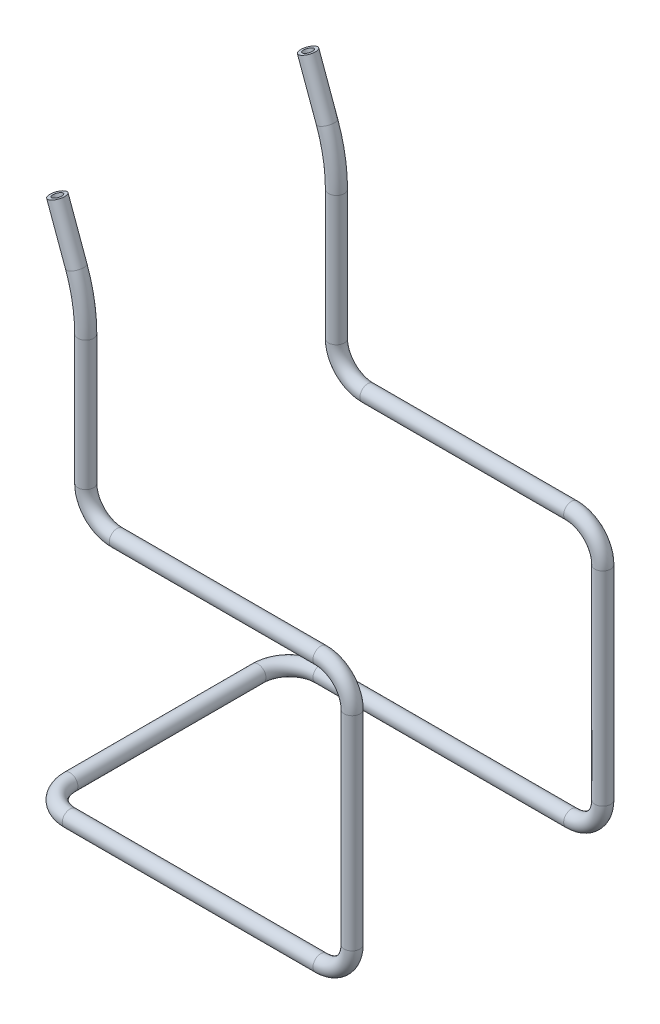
ISO-10303-21;
HEADER;
FILE_DESCRIPTION(('STEP AP214'),'2;1');
FILE_NAME('part.step','',(''),(''),'','','');
FILE_SCHEMA(('AUTOMOTIVE_DESIGN { 1 0 10303 214 1 1 1 1 }'));
ENDSEC;
DATA;
#1=APPLICATION_CONTEXT('core data for automotive mechanical design processes');
#2=APPLICATION_PROTOCOL_DEFINITION('international standard','automotive_design',2000,#1);
#3=PRODUCT_CONTEXT('',#1,'mechanical');
#4=PRODUCT('Part','Part','',(#3));
#5=PRODUCT_RELATED_PRODUCT_CATEGORY('part','',(#4));
#6=PRODUCT_DEFINITION_FORMATION('','',#4);
#7=PRODUCT_DEFINITION_CONTEXT('part definition',#1,'design');
#8=PRODUCT_DEFINITION('design','',#6,#7);
#9=PRODUCT_DEFINITION_SHAPE('','',#8);
#10=(LENGTH_UNIT() NAMED_UNIT(*) SI_UNIT(.MILLI.,.METRE.));
#11=(NAMED_UNIT(*) PLANE_ANGLE_UNIT() SI_UNIT($,.RADIAN.));
#12=(NAMED_UNIT(*) SI_UNIT($,.STERADIAN.) SOLID_ANGLE_UNIT());
#13=UNCERTAINTY_MEASURE_WITH_UNIT(LENGTH_MEASURE(1.E-05),#10,'distance_accuracy_value','');
#14=(GEOMETRIC_REPRESENTATION_CONTEXT(3) GLOBAL_UNCERTAINTY_ASSIGNED_CONTEXT((#13)) GLOBAL_UNIT_ASSIGNED_CONTEXT((#10,
#11,#12)) REPRESENTATION_CONTEXT('',''));
#15=CARTESIAN_POINT('',(0.,0.,0.));
#16=DIRECTION('',(0.,0.,1.));
#17=DIRECTION('',(1.,0.,0.));
#18=AXIS2_PLACEMENT_3D('',#15,#16,#17);
#19=CARTESIAN_POINT('',(5.93646620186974,170.,40.));
#20=DIRECTION('',(0.34202014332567,-0.939692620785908,0.));
#21=DIRECTION('',(0.939692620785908,0.34202014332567,0.));
#22=AXIS2_PLACEMENT_3D('',#19,#20,#21);
#23=PLANE('',#22);
#24=CARTESIAN_POINT('',(5.93646620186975,170.,40.));
#25=DIRECTION('',(0.34202014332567,-0.939692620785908,0.));
#26=DIRECTION('',(0.939692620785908,0.34202014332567,0.));
#27=AXIS2_PLACEMENT_3D('',#24,#25,#26);
#28=CIRCLE('',#27,1.5);
#29=CARTESIAN_POINT('',(7.34600513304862,170.513030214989,40.));
#30=VERTEX_POINT('',#29);
#31=EDGE_CURVE('E94',#30,#30,#28,.T.);
#32=ORIENTED_EDGE('',*,*,#31,.T.);
#33=EDGE_LOOP('',(#32));
#34=FACE_BOUND('',#33,.T.);
#35=CARTESIAN_POINT('',(5.93646620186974,170.,40.));
#36=DIRECTION('',(0.34202014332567,-0.939692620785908,0.));
#37=DIRECTION('',(0.939692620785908,0.34202014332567,0.));
#38=AXIS2_PLACEMENT_3D('',#35,#36,#37);
#39=CIRCLE('',#38,2.5);
#40=CARTESIAN_POINT('',(8.28569775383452,170.855050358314,40.));
#41=VERTEX_POINT('',#40);
#42=EDGE_CURVE('E11',#41,#41,#39,.T.);
#43=ORIENTED_EDGE('',*,*,#42,.F.);
#44=EDGE_LOOP('',(#43));
#45=FACE_BOUND('',#44,.T.);
#46=ADVANCED_FACE('F54',(#34,#45),#23,.F.);
#47=CARTESIAN_POINT('',(0.,0.,0.));
#48=DIRECTION('',(0.,0.,1.));
#49=DIRECTION('',(1.,0.,0.));
#50=AXIS2_PLACEMENT_3D('',#47,#48,#49);
#51=CYLINDRICAL_SURFACE('',#50,2.5);
#52=CARTESIAN_POINT('',(0.,0.,30.0000000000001));
#53=DIRECTION('',(0.,0.,-1.));
#54=DIRECTION('',(0.,-1.,0.));
#55=AXIS2_PLACEMENT_3D('',#52,#53,#54);
#56=CIRCLE('',#55,2.5);
#57=CARTESIAN_POINT('',(-2.5,0.,30.0000000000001));
#58=VERTEX_POINT('',#57);
#59=EDGE_CURVE('E91',#58,#58,#56,.T.);
#60=ORIENTED_EDGE('',*,*,#59,.T.);
#61=EDGE_LOOP('',(#60));
#62=FACE_BOUND('',#61,.T.);
#63=CARTESIAN_POINT('',(0.,0.,-30.0000000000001));
#64=DIRECTION('',(0.,0.,-1.));
#65=DIRECTION('',(0.,-1.,0.));
#66=AXIS2_PLACEMENT_3D('',#63,#64,#65);
#67=CIRCLE('',#66,2.5);
#68=CARTESIAN_POINT('',(-2.5,0.,-30.0000000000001));
#69=VERTEX_POINT('',#68);
#70=EDGE_CURVE('E157',#69,#69,#67,.F.);
#71=ORIENTED_EDGE('',*,*,#70,.T.);
#72=EDGE_LOOP('',(#71));
#73=FACE_BOUND('',#72,.T.);
#74=ADVANCED_FACE('F304',(#62,#73),#51,.T.);
#75=CARTESIAN_POINT('',(10.,0.,30.));
#76=DIRECTION('',(0.,1.,0.));
#77=DIRECTION('',(0.,0.,1.));
#78=AXIS2_PLACEMENT_3D('',#75,#76,#77);
#79=TOROIDAL_SURFACE('',#78,10.,2.5);
#80=CARTESIAN_POINT('',(10.0000000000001,0.,40.));
#81=DIRECTION('',(-1.,0.,0.));
#82=DIRECTION('',(0.,-1.,0.));
#83=AXIS2_PLACEMENT_3D('',#80,#81,#82);
#84=CIRCLE('',#83,2.5);
#85=CARTESIAN_POINT('',(10.0000000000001,0.,42.5));
#86=VERTEX_POINT('',#85);
#87=EDGE_CURVE('E88',#86,#86,#84,.T.);
#88=CARTESIAN_POINT('',(10.,0.,30.));
#89=DIRECTION('',(0.,1.,0.));
#90=DIRECTION('',(0.,0.,1.));
#91=AXIS2_PLACEMENT_3D('',#88,#89,#90);
#92=CIRCLE('',#91,12.5);
#93=EDGE_CURVE('',#58,#86,#92,.T.);
#94=ORIENTED_EDGE('',*,*,#59,.F.);
#95=ORIENTED_EDGE('',*,*,#87,.T.);
#96=ORIENTED_EDGE('',*,*,#93,.T.);
#97=ORIENTED_EDGE('',*,*,#93,.F.);
#98=EDGE_LOOP('',(#94,#96,#95,#97));
#99=FACE_BOUND('',#98,.T.);
#100=ADVANCED_FACE('F306',(#99),#79,.T.);
#101=CARTESIAN_POINT('',(10.0000000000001,0.,40.));
#102=DIRECTION('',(1.,0.,0.));
#103=DIRECTION('',(0.,0.,-1.));
#104=AXIS2_PLACEMENT_3D('',#101,#102,#103);
#105=CYLINDRICAL_SURFACE('',#104,2.5);
#106=CARTESIAN_POINT('',(90.0000000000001,0.,40.));
#107=DIRECTION('',(-1.,0.,0.));
#108=DIRECTION('',(0.,-1.,0.));
#109=AXIS2_PLACEMENT_3D('',#106,#107,#108);
#110=CIRCLE('',#109,2.5);
#111=CARTESIAN_POINT('',(90.0000000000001,-2.49999999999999,40.));
#112=VERTEX_POINT('',#111);
#113=EDGE_CURVE('E85',#112,#112,#110,.T.);
#114=ORIENTED_EDGE('',*,*,#113,.T.);
#115=EDGE_LOOP('',(#114));
#116=FACE_BOUND('',#115,.T.);
#117=ORIENTED_EDGE('',*,*,#87,.F.);
#118=EDGE_LOOP('',(#117));
#119=FACE_BOUND('',#118,.T.);
#120=ADVANCED_FACE('F313',(#116,#119),#105,.T.);
#121=CARTESIAN_POINT('',(90.,10.,40.));
#122=DIRECTION('',(0.,0.,1.));
#123=DIRECTION('',(1.,0.,0.));
#124=AXIS2_PLACEMENT_3D('',#121,#122,#123);
#125=TOROIDAL_SURFACE('',#124,9.99999999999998,2.5);
#126=CARTESIAN_POINT('',(100.,10.0000000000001,40.));
#127=DIRECTION('',(0.,-1.,0.));
#128=DIRECTION('',(1.,0.,0.));
#129=AXIS2_PLACEMENT_3D('',#126,#127,#128);
#130=CIRCLE('',#129,2.5);
#131=CARTESIAN_POINT('',(102.5,10.0000000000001,40.));
#132=VERTEX_POINT('',#131);
#133=EDGE_CURVE('E82',#132,#132,#130,.T.);
#134=CARTESIAN_POINT('',(90.,10.,40.));
#135=DIRECTION('',(0.,0.,1.));
#136=DIRECTION('',(1.,0.,0.));
#137=AXIS2_PLACEMENT_3D('',#134,#135,#136);
#138=CIRCLE('',#137,12.5);
#139=EDGE_CURVE('',#112,#132,#138,.T.);
#140=ORIENTED_EDGE('',*,*,#113,.F.);
#141=ORIENTED_EDGE('',*,*,#133,.T.);
#142=ORIENTED_EDGE('',*,*,#139,.T.);
#143=ORIENTED_EDGE('',*,*,#139,.F.);
#144=EDGE_LOOP('',(#140,#142,#141,#143));
#145=FACE_BOUND('',#144,.T.);
#146=ADVANCED_FACE('F321',(#145),#125,.T.);
#147=CARTESIAN_POINT('',(100.,10.0000000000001,40.));
#148=DIRECTION('',(0.,1.,0.));
#149=DIRECTION('',(0.,0.,1.));
#150=AXIS2_PLACEMENT_3D('',#147,#148,#149);
#151=CYLINDRICAL_SURFACE('',#150,2.5);
#152=CARTESIAN_POINT('',(100.,75.0000000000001,40.));
#153=DIRECTION('',(0.,-1.,0.));
#154=DIRECTION('',(1.,0.,0.));
#155=AXIS2_PLACEMENT_3D('',#152,#153,#154);
#156=CIRCLE('',#155,2.5);
#157=CARTESIAN_POINT('',(102.5,75.0000000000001,40.));
#158=VERTEX_POINT('',#157);
#159=EDGE_CURVE('E79',#158,#158,#156,.T.);
#160=ORIENTED_EDGE('',*,*,#159,.T.);
#161=EDGE_LOOP('',(#160));
#162=FACE_BOUND('',#161,.T.);
#163=ORIENTED_EDGE('',*,*,#133,.F.);
#164=EDGE_LOOP('',(#163));
#165=FACE_BOUND('',#164,.T.);
#166=ADVANCED_FACE('F325',(#162,#165),#151,.T.);
#167=CARTESIAN_POINT('',(90.,75.,40.));
#168=DIRECTION('',(0.,0.,1.));
#169=DIRECTION('',(1.,0.,0.));
#170=AXIS2_PLACEMENT_3D('',#167,#168,#169);
#171=TOROIDAL_SURFACE('',#170,9.99999999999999,2.5);
#172=CARTESIAN_POINT('',(90.,85.,40.));
#173=DIRECTION('',(1.,0.,0.));
#174=DIRECTION('',(0.,1.,0.));
#175=AXIS2_PLACEMENT_3D('',#172,#173,#174);
#176=CIRCLE('',#175,2.5);
#177=CARTESIAN_POINT('',(90.,87.5,40.));
#178=VERTEX_POINT('',#177);
#179=EDGE_CURVE('E76',#178,#178,#176,.T.);
#180=CARTESIAN_POINT('',(90.,75.,40.));
#181=DIRECTION('',(0.,0.,1.));
#182=DIRECTION('',(1.,0.,0.));
#183=AXIS2_PLACEMENT_3D('',#180,#181,#182);
#184=CIRCLE('',#183,12.5);
#185=EDGE_CURVE('',#158,#178,#184,.T.);
#186=ORIENTED_EDGE('',*,*,#159,.F.);
#187=ORIENTED_EDGE('',*,*,#179,.T.);
#188=ORIENTED_EDGE('',*,*,#185,.T.);
#189=ORIENTED_EDGE('',*,*,#185,.F.);
#190=EDGE_LOOP('',(#186,#188,#187,#189));
#191=FACE_BOUND('',#190,.T.);
#192=ADVANCED_FACE('F329',(#191),#171,.T.);
#193=CARTESIAN_POINT('',(89.9999999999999,85.,40.));
#194=DIRECTION('',(-1.,0.,0.));
#195=DIRECTION('',(0.,0.,1.));
#196=AXIS2_PLACEMENT_3D('',#193,#194,#195);
#197=CYLINDRICAL_SURFACE('',#196,2.5);
#198=CARTESIAN_POINT('',(24.9999999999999,85.,40.));
#199=DIRECTION('',(1.,0.,0.));
#200=DIRECTION('',(0.,1.,0.));
#201=AXIS2_PLACEMENT_3D('',#198,#199,#200);
#202=CIRCLE('',#201,2.5);
#203=CARTESIAN_POINT('',(24.9999999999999,82.5,40.));
#204=VERTEX_POINT('',#203);
#205=EDGE_CURVE('E73',#204,#204,#202,.T.);
#206=ORIENTED_EDGE('',*,*,#205,.T.);
#207=EDGE_LOOP('',(#206));
#208=FACE_BOUND('',#207,.T.);
#209=ORIENTED_EDGE('',*,*,#179,.F.);
#210=EDGE_LOOP('',(#209));
#211=FACE_BOUND('',#210,.T.);
#212=ADVANCED_FACE('F333',(#208,#211),#197,.T.);
#213=CARTESIAN_POINT('',(25.,95.,40.));
#214=DIRECTION('',(0.,0.,-1.));
#215=DIRECTION('',(-1.,0.,0.));
#216=AXIS2_PLACEMENT_3D('',#213,#214,#215);
#217=TOROIDAL_SURFACE('',#216,9.99999999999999,2.5);
#218=CARTESIAN_POINT('',(15.,95.0000000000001,40.));
#219=DIRECTION('',(0.,-1.,0.));
#220=DIRECTION('',(1.,0.,0.));
#221=AXIS2_PLACEMENT_3D('',#218,#219,#220);
#222=CIRCLE('',#221,2.5);
#223=CARTESIAN_POINT('',(12.5,95.0000000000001,40.));
#224=VERTEX_POINT('',#223);
#225=EDGE_CURVE('E68',#224,#224,#222,.T.);
#226=CARTESIAN_POINT('',(25.,95.,40.));
#227=DIRECTION('',(0.,0.,-1.));
#228=DIRECTION('',(-1.,0.,0.));
#229=AXIS2_PLACEMENT_3D('',#226,#227,#228);
#230=CIRCLE('',#229,12.5);
#231=EDGE_CURVE('',#204,#224,#230,.T.);
#232=ORIENTED_EDGE('',*,*,#205,.F.);
#233=ORIENTED_EDGE('',*,*,#225,.T.);
#234=ORIENTED_EDGE('',*,*,#231,.T.);
#235=ORIENTED_EDGE('',*,*,#231,.F.);
#236=EDGE_LOOP('',(#232,#234,#233,#235));
#237=FACE_BOUND('',#236,.T.);
#238=ADVANCED_FACE('F337',(#237),#217,.T.);
#239=CARTESIAN_POINT('',(15.,95.0000000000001,40.));
#240=DIRECTION('',(0.,1.,0.));
#241=DIRECTION('',(-1.,0.,0.));
#242=AXIS2_PLACEMENT_3D('',#239,#240,#241);
#243=CYLINDRICAL_SURFACE('',#242,2.5);
#244=CARTESIAN_POINT('',(15.,136.28179651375,40.));
#245=DIRECTION('',(0.,-1.,0.));
#246=DIRECTION('',(1.,0.,0.));
#247=AXIS2_PLACEMENT_3D('',#244,#245,#246);
#248=CIRCLE('',#247,2.5);
#249=CARTESIAN_POINT('',(17.5,136.28179651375,40.));
#250=VERTEX_POINT('',#249);
#251=EDGE_CURVE('E64',#250,#250,#248,.T.);
#252=ORIENTED_EDGE('',*,*,#251,.T.);
#253=EDGE_LOOP('',(#252));
#254=FACE_BOUND('',#253,.T.);
#255=ORIENTED_EDGE('',*,*,#225,.F.);
#256=EDGE_LOOP('',(#255));
#257=FACE_BOUND('',#256,.T.);
#258=ADVANCED_FACE('F341',(#254,#257),#243,.T.);
#259=CARTESIAN_POINT('',(-35.,136.28179651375,40.));
#260=DIRECTION('',(0.,0.,1.));
#261=DIRECTION('',(1.,0.,0.));
#262=AXIS2_PLACEMENT_3D('',#259,#260,#261);
#263=TOROIDAL_SURFACE('',#262,50.,2.5);
#264=CARTESIAN_POINT('',(11.9846310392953,153.382803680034,40.));
#265=DIRECTION('',(0.34202014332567,-0.939692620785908,0.));
#266=DIRECTION('',(0.939692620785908,0.34202014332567,0.));
#267=AXIS2_PLACEMENT_3D('',#264,#265,#266);
#268=CIRCLE('',#267,2.5);
#269=CARTESIAN_POINT('',(14.3338625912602,154.237854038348,40.));
#270=VERTEX_POINT('',#269);
#271=EDGE_CURVE('E60',#270,#270,#268,.T.);
#272=CARTESIAN_POINT('',(-35.,136.28179651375,40.));
#273=DIRECTION('',(0.,0.,1.));
#274=DIRECTION('',(1.,0.,0.));
#275=AXIS2_PLACEMENT_3D('',#272,#273,#274);
#276=CIRCLE('',#275,52.5);
#277=EDGE_CURVE('',#250,#270,#276,.T.);
#278=ORIENTED_EDGE('',*,*,#251,.F.);
#279=ORIENTED_EDGE('',*,*,#271,.T.);
#280=ORIENTED_EDGE('',*,*,#277,.T.);
#281=ORIENTED_EDGE('',*,*,#277,.F.);
#282=EDGE_LOOP('',(#278,#280,#279,#281));
#283=FACE_BOUND('',#282,.T.);
#284=ADVANCED_FACE('F210',(#283),#263,.T.);
#285=CARTESIAN_POINT('',(11.9846310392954,153.382803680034,40.));
#286=DIRECTION('',(-0.342020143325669,0.939692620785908,0.));
#287=DIRECTION('',(-0.939692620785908,-0.342020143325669,0.));
#288=AXIS2_PLACEMENT_3D('',#285,#286,#287);
#289=CYLINDRICAL_SURFACE('',#288,2.5);
#290=ORIENTED_EDGE('',*,*,#42,.T.);
#291=EDGE_LOOP('',(#290));
#292=FACE_BOUND('',#291,.T.);
#293=ORIENTED_EDGE('',*,*,#271,.F.);
#294=EDGE_LOOP('',(#293));
#295=FACE_BOUND('',#294,.T.);
#296=ADVANCED_FACE('F199',(#292,#295),#289,.T.);
#297=CARTESIAN_POINT('',(0.,0.,0.));
#298=DIRECTION('',(0.,0.,1.));
#299=DIRECTION('',(1.,0.,0.));
#300=AXIS2_PLACEMENT_3D('',#297,#298,#299);
#301=CYLINDRICAL_SURFACE('',#300,1.5);
#302=CARTESIAN_POINT('',(0.,0.,30.0000000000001));
#303=DIRECTION('',(0.,0.,1.));
#304=DIRECTION('',(1.,0.,0.));
#305=AXIS2_PLACEMENT_3D('',#302,#303,#304);
#306=CIRCLE('',#305,1.5);
#307=CARTESIAN_POINT('',(-1.5,0.,30.0000000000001));
#308=VERTEX_POINT('',#307);
#309=EDGE_CURVE('E124',#308,#308,#306,.F.);
#310=ORIENTED_EDGE('',*,*,#309,.F.);
#311=EDGE_LOOP('',(#310));
#312=FACE_BOUND('',#311,.T.);
#313=CARTESIAN_POINT('',(0.,0.,-30.0000000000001));
#314=DIRECTION('',(0.,0.,-1.));
#315=DIRECTION('',(-1.,0.,0.));
#316=AXIS2_PLACEMENT_3D('',#313,#314,#315);
#317=CIRCLE('',#316,1.5);
#318=CARTESIAN_POINT('',(-1.5,0.,-30.0000000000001));
#319=VERTEX_POINT('',#318);
#320=EDGE_CURVE('E190',#319,#319,#317,.F.);
#321=ORIENTED_EDGE('',*,*,#320,.F.);
#322=EDGE_LOOP('',(#321));
#323=FACE_BOUND('',#322,.T.);
#324=ADVANCED_FACE('F196',(#312,#323),#301,.F.);
#325=CARTESIAN_POINT('',(10.,0.,30.));
#326=DIRECTION('',(0.,1.,0.));
#327=DIRECTION('',(0.,0.,1.));
#328=AXIS2_PLACEMENT_3D('',#325,#326,#327);
#329=TOROIDAL_SURFACE('',#328,10.,1.5);
#330=CARTESIAN_POINT('',(10.0000000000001,0.,40.));
#331=DIRECTION('',(-1.,0.,0.));
#332=DIRECTION('',(0.,0.,1.));
#333=AXIS2_PLACEMENT_3D('',#330,#331,#332);
#334=CIRCLE('',#333,1.5);
#335=CARTESIAN_POINT('',(10.0000000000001,0.,41.5));
#336=VERTEX_POINT('',#335);
#337=EDGE_CURVE('E121',#336,#336,#334,.T.);
#338=CARTESIAN_POINT('',(10.,0.,30.));
#339=DIRECTION('',(0.,1.,0.));
#340=DIRECTION('',(0.,0.,1.));
#341=AXIS2_PLACEMENT_3D('',#338,#339,#340);
#342=CIRCLE('',#341,11.5);
#343=EDGE_CURVE('',#308,#336,#342,.T.);
#344=ORIENTED_EDGE('',*,*,#309,.T.);
#345=ORIENTED_EDGE('',*,*,#337,.F.);
#346=ORIENTED_EDGE('',*,*,#343,.T.);
#347=ORIENTED_EDGE('',*,*,#343,.F.);
#348=EDGE_LOOP('',(#344,#346,#345,#347));
#349=FACE_BOUND('',#348,.T.);
#350=ADVANCED_FACE('F198',(#349),#329,.F.);
#351=CARTESIAN_POINT('',(10.0000000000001,0.,40.));
#352=DIRECTION('',(1.,0.,0.));
#353=DIRECTION('',(0.,0.,-1.));
#354=AXIS2_PLACEMENT_3D('',#351,#352,#353);
#355=CYLINDRICAL_SURFACE('',#354,1.5);
#356=CARTESIAN_POINT('',(90.0000000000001,0.,40.));
#357=DIRECTION('',(1.,0.,0.));
#358=DIRECTION('',(0.,0.,-1.));
#359=AXIS2_PLACEMENT_3D('',#356,#357,#358);
#360=CIRCLE('',#359,1.5);
#361=CARTESIAN_POINT('',(90.0000000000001,-1.49999999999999,40.));
#362=VERTEX_POINT('',#361);
#363=EDGE_CURVE('E118',#362,#362,#360,.F.);
#364=ORIENTED_EDGE('',*,*,#363,.F.);
#365=EDGE_LOOP('',(#364));
#366=FACE_BOUND('',#365,.T.);
#367=ORIENTED_EDGE('',*,*,#337,.T.);
#368=EDGE_LOOP('',(#367));
#369=FACE_BOUND('',#368,.T.);
#370=ADVANCED_FACE('F207',(#366,#369),#355,.F.);
#371=CARTESIAN_POINT('',(90.,10.,40.));
#372=DIRECTION('',(0.,0.,1.));
#373=DIRECTION('',(1.,0.,0.));
#374=AXIS2_PLACEMENT_3D('',#371,#372,#373);
#375=TOROIDAL_SURFACE('',#374,9.99999999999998,1.5);
#376=CARTESIAN_POINT('',(100.,10.0000000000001,40.));
#377=DIRECTION('',(0.,-1.,0.));
#378=DIRECTION('',(1.,0.,0.));
#379=AXIS2_PLACEMENT_3D('',#376,#377,#378);
#380=CIRCLE('',#379,1.5);
#381=CARTESIAN_POINT('',(101.5,10.0000000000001,40.));
#382=VERTEX_POINT('',#381);
#383=EDGE_CURVE('E115',#382,#382,#380,.T.);
#384=CARTESIAN_POINT('',(90.,10.,40.));
#385=DIRECTION('',(0.,0.,1.));
#386=DIRECTION('',(1.,0.,0.));
#387=AXIS2_PLACEMENT_3D('',#384,#385,#386);
#388=CIRCLE('',#387,11.5);
#389=EDGE_CURVE('',#362,#382,#388,.T.);
#390=ORIENTED_EDGE('',*,*,#363,.T.);
#391=ORIENTED_EDGE('',*,*,#383,.F.);
#392=ORIENTED_EDGE('',*,*,#389,.T.);
#393=ORIENTED_EDGE('',*,*,#389,.F.);
#394=EDGE_LOOP('',(#390,#392,#391,#393));
#395=FACE_BOUND('',#394,.T.);
#396=ADVANCED_FACE('F389',(#395),#375,.F.);
#397=CARTESIAN_POINT('',(100.,10.0000000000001,40.));
#398=DIRECTION('',(0.,1.,0.));
#399=DIRECTION('',(0.,0.,1.));
#400=AXIS2_PLACEMENT_3D('',#397,#398,#399);
#401=CYLINDRICAL_SURFACE('',#400,1.5);
#402=CARTESIAN_POINT('',(100.,75.0000000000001,40.));
#403=DIRECTION('',(0.,1.,0.));
#404=DIRECTION('',(0.,0.,1.));
#405=AXIS2_PLACEMENT_3D('',#402,#403,#404);
#406=CIRCLE('',#405,1.5);
#407=CARTESIAN_POINT('',(101.5,75.0000000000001,40.));
#408=VERTEX_POINT('',#407);
#409=EDGE_CURVE('E112',#408,#408,#406,.F.);
#410=ORIENTED_EDGE('',*,*,#409,.F.);
#411=EDGE_LOOP('',(#410));
#412=FACE_BOUND('',#411,.T.);
#413=ORIENTED_EDGE('',*,*,#383,.T.);
#414=EDGE_LOOP('',(#413));
#415=FACE_BOUND('',#414,.T.);
#416=ADVANCED_FACE('F399',(#412,#415),#401,.F.);
#417=CARTESIAN_POINT('',(90.,75.,40.));
#418=DIRECTION('',(0.,0.,1.));
#419=DIRECTION('',(1.,0.,0.));
#420=AXIS2_PLACEMENT_3D('',#417,#418,#419);
#421=TOROIDAL_SURFACE('',#420,9.99999999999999,1.5);
#422=CARTESIAN_POINT('',(90.,85.,40.));
#423=DIRECTION('',(1.,0.,0.));
#424=DIRECTION('',(0.,1.,0.));
#425=AXIS2_PLACEMENT_3D('',#422,#423,#424);
#426=CIRCLE('',#425,1.5);
#427=CARTESIAN_POINT('',(89.9999999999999,86.5,40.));
#428=VERTEX_POINT('',#427);
#429=EDGE_CURVE('E109',#428,#428,#426,.T.);
#430=CARTESIAN_POINT('',(90.,75.,40.));
#431=DIRECTION('',(0.,0.,1.));
#432=DIRECTION('',(1.,0.,0.));
#433=AXIS2_PLACEMENT_3D('',#430,#431,#432);
#434=CIRCLE('',#433,11.5);
#435=EDGE_CURVE('',#408,#428,#434,.T.);
#436=ORIENTED_EDGE('',*,*,#409,.T.);
#437=ORIENTED_EDGE('',*,*,#429,.F.);
#438=ORIENTED_EDGE('',*,*,#435,.T.);
#439=ORIENTED_EDGE('',*,*,#435,.F.);
#440=EDGE_LOOP('',(#436,#438,#437,#439));
#441=FACE_BOUND('',#440,.T.);
#442=ADVANCED_FACE('F409',(#441),#421,.F.);
#443=CARTESIAN_POINT('',(89.9999999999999,85.,40.));
#444=DIRECTION('',(-1.,0.,0.));
#445=DIRECTION('',(0.,0.,1.));
#446=AXIS2_PLACEMENT_3D('',#443,#444,#445);
#447=CYLINDRICAL_SURFACE('',#446,1.5);
#448=CARTESIAN_POINT('',(24.9999999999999,85.,40.));
#449=DIRECTION('',(-1.,0.,0.));
#450=DIRECTION('',(0.,0.,1.));
#451=AXIS2_PLACEMENT_3D('',#448,#449,#450);
#452=CIRCLE('',#451,1.5);
#453=CARTESIAN_POINT('',(24.9999999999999,83.5,40.));
#454=VERTEX_POINT('',#453);
#455=EDGE_CURVE('E106',#454,#454,#452,.F.);
#456=ORIENTED_EDGE('',*,*,#455,.F.);
#457=EDGE_LOOP('',(#456));
#458=FACE_BOUND('',#457,.T.);
#459=ORIENTED_EDGE('',*,*,#429,.T.);
#460=EDGE_LOOP('',(#459));
#461=FACE_BOUND('',#460,.T.);
#462=ADVANCED_FACE('F419',(#458,#461),#447,.F.);
#463=CARTESIAN_POINT('',(25.,95.,40.));
#464=DIRECTION('',(0.,0.,-1.));
#465=DIRECTION('',(-1.,0.,0.));
#466=AXIS2_PLACEMENT_3D('',#463,#464,#465);
#467=TOROIDAL_SURFACE('',#466,9.99999999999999,1.5);
#468=CARTESIAN_POINT('',(15.,95.,40.));
#469=DIRECTION('',(0.,-1.,0.));
#470=DIRECTION('',(1.,0.,0.));
#471=AXIS2_PLACEMENT_3D('',#468,#469,#470);
#472=CIRCLE('',#471,1.5);
#473=CARTESIAN_POINT('',(13.5,95.,40.));
#474=VERTEX_POINT('',#473);
#475=EDGE_CURVE('E103',#474,#474,#472,.T.);
#476=CARTESIAN_POINT('',(25.,95.,40.));
#477=DIRECTION('',(0.,0.,-1.));
#478=DIRECTION('',(-1.,0.,0.));
#479=AXIS2_PLACEMENT_3D('',#476,#477,#478);
#480=CIRCLE('',#479,11.5);
#481=EDGE_CURVE('',#454,#474,#480,.T.);
#482=ORIENTED_EDGE('',*,*,#455,.T.);
#483=ORIENTED_EDGE('',*,*,#475,.F.);
#484=ORIENTED_EDGE('',*,*,#481,.T.);
#485=ORIENTED_EDGE('',*,*,#481,.F.);
#486=EDGE_LOOP('',(#482,#484,#483,#485));
#487=FACE_BOUND('',#486,.T.);
#488=ADVANCED_FACE('F429',(#487),#467,.F.);
#489=CARTESIAN_POINT('',(15.,95.0000000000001,40.));
#490=DIRECTION('',(0.,1.,0.));
#491=DIRECTION('',(-1.,0.,0.));
#492=AXIS2_PLACEMENT_3D('',#489,#490,#491);
#493=CYLINDRICAL_SURFACE('',#492,1.5);
#494=CARTESIAN_POINT('',(15.,136.28179651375,40.));
#495=DIRECTION('',(0.,1.,0.));
#496=DIRECTION('',(-1.,0.,0.));
#497=AXIS2_PLACEMENT_3D('',#494,#495,#496);
#498=CIRCLE('',#497,1.5);
#499=CARTESIAN_POINT('',(16.5,136.28179651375,40.));
#500=VERTEX_POINT('',#499);
#501=EDGE_CURVE('E100',#500,#500,#498,.F.);
#502=ORIENTED_EDGE('',*,*,#501,.F.);
#503=EDGE_LOOP('',(#502));
#504=FACE_BOUND('',#503,.T.);
#505=ORIENTED_EDGE('',*,*,#475,.T.);
#506=EDGE_LOOP('',(#505));
#507=FACE_BOUND('',#506,.T.);
#508=ADVANCED_FACE('F439',(#504,#507),#493,.F.);
#509=CARTESIAN_POINT('',(-35.,136.28179651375,40.));
#510=DIRECTION('',(0.,0.,1.));
#511=DIRECTION('',(1.,0.,0.));
#512=AXIS2_PLACEMENT_3D('',#509,#510,#511);
#513=TOROIDAL_SURFACE('',#512,50.,1.5);
#514=CARTESIAN_POINT('',(11.9846310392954,153.382803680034,40.));
#515=DIRECTION('',(0.34202014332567,-0.939692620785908,0.));
#516=DIRECTION('',(0.939692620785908,0.34202014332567,0.));
#517=AXIS2_PLACEMENT_3D('',#514,#515,#516);
#518=CIRCLE('',#517,1.5);
#519=CARTESIAN_POINT('',(13.3941699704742,153.895833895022,40.));
#520=VERTEX_POINT('',#519);
#521=EDGE_CURVE('E97',#520,#520,#518,.T.);
#522=CARTESIAN_POINT('',(-35.,136.28179651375,40.));
#523=DIRECTION('',(0.,0.,1.));
#524=DIRECTION('',(1.,0.,0.));
#525=AXIS2_PLACEMENT_3D('',#522,#523,#524);
#526=CIRCLE('',#525,51.5);
#527=EDGE_CURVE('',#500,#520,#526,.T.);
#528=ORIENTED_EDGE('',*,*,#501,.T.);
#529=ORIENTED_EDGE('',*,*,#521,.F.);
#530=ORIENTED_EDGE('',*,*,#527,.T.);
#531=ORIENTED_EDGE('',*,*,#527,.F.);
#532=EDGE_LOOP('',(#528,#530,#529,#531));
#533=FACE_BOUND('',#532,.T.);
#534=ADVANCED_FACE('F242',(#533),#513,.F.);
#535=CARTESIAN_POINT('',(11.9846310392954,153.382803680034,40.));
#536=DIRECTION('',(-0.342020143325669,0.939692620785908,0.));
#537=DIRECTION('',(-0.939692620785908,-0.342020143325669,0.));
#538=AXIS2_PLACEMENT_3D('',#535,#536,#537);
#539=CYLINDRICAL_SURFACE('',#538,1.5);
#540=ORIENTED_EDGE('',*,*,#31,.F.);
#541=EDGE_LOOP('',(#540));
#542=FACE_BOUND('',#541,.T.);
#543=ORIENTED_EDGE('',*,*,#521,.T.);
#544=EDGE_LOOP('',(#543));
#545=FACE_BOUND('',#544,.T.);
#546=ADVANCED_FACE('F232',(#542,#545),#539,.F.);
#547=CARTESIAN_POINT('',(5.93646620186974,170.,-40.));
#548=DIRECTION('',(0.34202014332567,-0.939692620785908,0.));
#549=DIRECTION('',(0.939692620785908,0.34202014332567,0.));
#550=AXIS2_PLACEMENT_3D('',#547,#548,#549);
#551=PLANE('',#550);
#552=CARTESIAN_POINT('',(5.93646620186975,170.,-40.));
#553=DIRECTION('',(0.34202014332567,-0.939692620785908,0.));
#554=DIRECTION('',(0.939692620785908,0.34202014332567,0.));
#555=AXIS2_PLACEMENT_3D('',#552,#553,#554);
#556=CIRCLE('',#555,1.5);
#557=CARTESIAN_POINT('',(7.34600513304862,170.513030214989,-40.));
#558=VERTEX_POINT('',#557);
#559=EDGE_CURVE('E160',#558,#558,#556,.T.);
#560=ORIENTED_EDGE('',*,*,#559,.T.);
#561=EDGE_LOOP('',(#560));
#562=FACE_BOUND('',#561,.T.);
#563=CARTESIAN_POINT('',(5.93646620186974,170.,-40.));
#564=DIRECTION('',(-0.34202014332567,0.939692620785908,0.));
#565=DIRECTION('',(0.939692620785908,0.34202014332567,0.));
#566=AXIS2_PLACEMENT_3D('',#563,#564,#565);
#567=CIRCLE('',#566,2.5);
#568=CARTESIAN_POINT('',(8.28569775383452,170.855050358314,-40.));
#569=VERTEX_POINT('',#568);
#570=EDGE_CURVE('E127',#569,#569,#567,.F.);
#571=ORIENTED_EDGE('',*,*,#570,.F.);
#572=EDGE_LOOP('',(#571));
#573=FACE_BOUND('',#572,.T.);
#574=ADVANCED_FACE('F229',(#562,#573),#551,.F.);
#575=CARTESIAN_POINT('',(10.,0.,-30.));
#576=DIRECTION('',(0.,-1.,0.));
#577=DIRECTION('',(0.,0.,-1.));
#578=AXIS2_PLACEMENT_3D('',#575,#576,#577);
#579=TOROIDAL_SURFACE('',#578,10.,2.5);
#580=CARTESIAN_POINT('',(10.0000000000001,0.,-40.));
#581=DIRECTION('',(1.,0.,0.));
#582=DIRECTION('',(0.,-1.,0.));
#583=AXIS2_PLACEMENT_3D('',#580,#581,#582);
#584=CIRCLE('',#583,2.5);
#585=CARTESIAN_POINT('',(10.0000000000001,0.,-42.5));
#586=VERTEX_POINT('',#585);
#587=EDGE_CURVE('E154',#586,#586,#584,.F.);
#588=CARTESIAN_POINT('',(10.,0.,-30.));
#589=DIRECTION('',(0.,-1.,0.));
#590=DIRECTION('',(0.,0.,-1.));
#591=AXIS2_PLACEMENT_3D('',#588,#589,#590);
#592=CIRCLE('',#591,12.5);
#593=EDGE_CURVE('',#69,#586,#592,.T.);
#594=ORIENTED_EDGE('',*,*,#70,.F.);
#595=ORIENTED_EDGE('',*,*,#587,.T.);
#596=ORIENTED_EDGE('',*,*,#593,.T.);
#597=ORIENTED_EDGE('',*,*,#593,.F.);
#598=EDGE_LOOP('',(#594,#596,#595,#597));
#599=FACE_BOUND('',#598,.T.);
#600=ADVANCED_FACE('F231',(#599),#579,.T.);
#601=CARTESIAN_POINT('',(10.0000000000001,0.,-40.));
#602=DIRECTION('',(1.,0.,0.));
#603=DIRECTION('',(0.,0.,-1.));
#604=AXIS2_PLACEMENT_3D('',#601,#602,#603);
#605=CYLINDRICAL_SURFACE('',#604,2.5);
#606=CARTESIAN_POINT('',(90.0000000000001,0.,-40.));
#607=DIRECTION('',(1.,0.,0.));
#608=DIRECTION('',(0.,-1.,0.));
#609=AXIS2_PLACEMENT_3D('',#606,#607,#608);
#610=CIRCLE('',#609,2.5);
#611=CARTESIAN_POINT('',(90.0000000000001,-2.49999999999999,-40.));
#612=VERTEX_POINT('',#611);
#613=EDGE_CURVE('E151',#612,#612,#610,.F.);
#614=ORIENTED_EDGE('',*,*,#613,.T.);
#615=EDGE_LOOP('',(#614));
#616=FACE_BOUND('',#615,.T.);
#617=ORIENTED_EDGE('',*,*,#587,.F.);
#618=EDGE_LOOP('',(#617));
#619=FACE_BOUND('',#618,.T.);
#620=ADVANCED_FACE('F239',(#616,#619),#605,.T.);
#621=CARTESIAN_POINT('',(90.,10.,-40.));
#622=DIRECTION('',(0.,0.,1.));
#623=DIRECTION('',(1.,0.,0.));
#624=AXIS2_PLACEMENT_3D('',#621,#622,#623);
#625=TOROIDAL_SURFACE('',#624,9.99999999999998,2.5);
#626=CARTESIAN_POINT('',(100.,10.0000000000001,-40.));
#627=DIRECTION('',(0.,1.,0.));
#628=DIRECTION('',(1.,0.,0.));
#629=AXIS2_PLACEMENT_3D('',#626,#627,#628);
#630=CIRCLE('',#629,2.5);
#631=CARTESIAN_POINT('',(102.5,10.0000000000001,-40.));
#632=VERTEX_POINT('',#631);
#633=EDGE_CURVE('E148',#632,#632,#630,.F.);
#634=CARTESIAN_POINT('',(90.,10.,-40.));
#635=DIRECTION('',(0.,0.,1.));
#636=DIRECTION('',(1.,0.,0.));
#637=AXIS2_PLACEMENT_3D('',#634,#635,#636);
#638=CIRCLE('',#637,12.5);
#639=EDGE_CURVE('',#612,#632,#638,.T.);
#640=ORIENTED_EDGE('',*,*,#613,.F.);
#641=ORIENTED_EDGE('',*,*,#633,.T.);
#642=ORIENTED_EDGE('',*,*,#639,.T.);
#643=ORIENTED_EDGE('',*,*,#639,.F.);
#644=EDGE_LOOP('',(#640,#642,#641,#643));
#645=FACE_BOUND('',#644,.T.);
#646=ADVANCED_FACE('F262',(#645),#625,.T.);
#647=CARTESIAN_POINT('',(100.,10.0000000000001,-40.));
#648=DIRECTION('',(0.,1.,0.));
#649=DIRECTION('',(0.,0.,1.));
#650=AXIS2_PLACEMENT_3D('',#647,#648,#649);
#651=CYLINDRICAL_SURFACE('',#650,2.5);
#652=CARTESIAN_POINT('',(100.,75.0000000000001,-40.));
#653=DIRECTION('',(0.,1.,0.));
#654=DIRECTION('',(1.,0.,0.));
#655=AXIS2_PLACEMENT_3D('',#652,#653,#654);
#656=CIRCLE('',#655,2.5);
#657=CARTESIAN_POINT('',(102.5,75.0000000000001,-40.));
#658=VERTEX_POINT('',#657);
#659=EDGE_CURVE('E145',#658,#658,#656,.F.);
#660=ORIENTED_EDGE('',*,*,#659,.T.);
#661=EDGE_LOOP('',(#660));
#662=FACE_BOUND('',#661,.T.);
#663=ORIENTED_EDGE('',*,*,#633,.F.);
#664=EDGE_LOOP('',(#663));
#665=FACE_BOUND('',#664,.T.);
#666=ADVANCED_FACE('F266',(#662,#665),#651,.T.);
#667=CARTESIAN_POINT('',(90.,75.,-40.));
#668=DIRECTION('',(0.,0.,1.));
#669=DIRECTION('',(1.,0.,0.));
#670=AXIS2_PLACEMENT_3D('',#667,#668,#669);
#671=TOROIDAL_SURFACE('',#670,9.99999999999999,2.5);
#672=CARTESIAN_POINT('',(90.,85.,-40.));
#673=DIRECTION('',(-1.,0.,0.));
#674=DIRECTION('',(0.,1.,0.));
#675=AXIS2_PLACEMENT_3D('',#672,#673,#674);
#676=CIRCLE('',#675,2.5);
#677=CARTESIAN_POINT('',(90.,87.5,-40.));
#678=VERTEX_POINT('',#677);
#679=EDGE_CURVE('E142',#678,#678,#676,.F.);
#680=CARTESIAN_POINT('',(90.,75.,-40.));
#681=DIRECTION('',(0.,0.,1.));
#682=DIRECTION('',(1.,0.,0.));
#683=AXIS2_PLACEMENT_3D('',#680,#681,#682);
#684=CIRCLE('',#683,12.5);
#685=EDGE_CURVE('',#658,#678,#684,.T.);
#686=ORIENTED_EDGE('',*,*,#659,.F.);
#687=ORIENTED_EDGE('',*,*,#679,.T.);
#688=ORIENTED_EDGE('',*,*,#685,.T.);
#689=ORIENTED_EDGE('',*,*,#685,.F.);
#690=EDGE_LOOP('',(#686,#688,#687,#689));
#691=FACE_BOUND('',#690,.T.);
#692=ADVANCED_FACE('F270',(#691),#671,.T.);
#693=CARTESIAN_POINT('',(89.9999999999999,85.,-40.));
#694=DIRECTION('',(-1.,0.,0.));
#695=DIRECTION('',(0.,0.,1.));
#696=AXIS2_PLACEMENT_3D('',#693,#694,#695);
#697=CYLINDRICAL_SURFACE('',#696,2.5);
#698=CARTESIAN_POINT('',(24.9999999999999,85.,-40.));
#699=DIRECTION('',(-1.,0.,0.));
#700=DIRECTION('',(0.,1.,0.));
#701=AXIS2_PLACEMENT_3D('',#698,#699,#700);
#702=CIRCLE('',#701,2.5);
#703=CARTESIAN_POINT('',(24.9999999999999,82.5,-40.));
#704=VERTEX_POINT('',#703);
#705=EDGE_CURVE('E139',#704,#704,#702,.F.);
#706=ORIENTED_EDGE('',*,*,#705,.T.);
#707=EDGE_LOOP('',(#706));
#708=FACE_BOUND('',#707,.T.);
#709=ORIENTED_EDGE('',*,*,#679,.F.);
#710=EDGE_LOOP('',(#709));
#711=FACE_BOUND('',#710,.T.);
#712=ADVANCED_FACE('F274',(#708,#711),#697,.T.);
#713=CARTESIAN_POINT('',(25.,95.,-40.));
#714=DIRECTION('',(0.,0.,-1.));
#715=DIRECTION('',(-1.,0.,0.));
#716=AXIS2_PLACEMENT_3D('',#713,#714,#715);
#717=TOROIDAL_SURFACE('',#716,9.99999999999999,2.5);
#718=CARTESIAN_POINT('',(15.,95.0000000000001,-40.));
#719=DIRECTION('',(0.,1.,0.));
#720=DIRECTION('',(1.,0.,0.));
#721=AXIS2_PLACEMENT_3D('',#718,#719,#720);
#722=CIRCLE('',#721,2.5);
#723=CARTESIAN_POINT('',(12.5,95.0000000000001,-40.));
#724=VERTEX_POINT('',#723);
#725=EDGE_CURVE('E136',#724,#724,#722,.F.);
#726=CARTESIAN_POINT('',(25.,95.,-40.));
#727=DIRECTION('',(0.,0.,-1.));
#728=DIRECTION('',(-1.,0.,0.));
#729=AXIS2_PLACEMENT_3D('',#726,#727,#728);
#730=CIRCLE('',#729,12.5);
#731=EDGE_CURVE('',#704,#724,#730,.T.);
#732=ORIENTED_EDGE('',*,*,#705,.F.);
#733=ORIENTED_EDGE('',*,*,#725,.T.);
#734=ORIENTED_EDGE('',*,*,#731,.T.);
#735=ORIENTED_EDGE('',*,*,#731,.F.);
#736=EDGE_LOOP('',(#732,#734,#733,#735));
#737=FACE_BOUND('',#736,.T.);
#738=ADVANCED_FACE('F278',(#737),#717,.T.);
#739=CARTESIAN_POINT('',(15.,95.0000000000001,-40.));
#740=DIRECTION('',(0.,1.,0.));
#741=DIRECTION('',(-1.,0.,0.));
#742=AXIS2_PLACEMENT_3D('',#739,#740,#741);
#743=CYLINDRICAL_SURFACE('',#742,2.5);
#744=CARTESIAN_POINT('',(15.,136.28179651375,-40.));
#745=DIRECTION('',(0.,1.,0.));
#746=DIRECTION('',(1.,0.,0.));
#747=AXIS2_PLACEMENT_3D('',#744,#745,#746);
#748=CIRCLE('',#747,2.5);
#749=CARTESIAN_POINT('',(17.5,136.28179651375,-40.));
#750=VERTEX_POINT('',#749);
#751=EDGE_CURVE('E133',#750,#750,#748,.F.);
#752=ORIENTED_EDGE('',*,*,#751,.T.);
#753=EDGE_LOOP('',(#752));
#754=FACE_BOUND('',#753,.T.);
#755=ORIENTED_EDGE('',*,*,#725,.F.);
#756=EDGE_LOOP('',(#755));
#757=FACE_BOUND('',#756,.T.);
#758=ADVANCED_FACE('F224',(#754,#757),#743,.T.);
#759=CARTESIAN_POINT('',(-35.,136.28179651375,-40.));
#760=DIRECTION('',(0.,0.,1.));
#761=DIRECTION('',(1.,0.,0.));
#762=AXIS2_PLACEMENT_3D('',#759,#760,#761);
#763=TOROIDAL_SURFACE('',#762,50.,2.5);
#764=CARTESIAN_POINT('',(11.9846310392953,153.382803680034,-40.));
#765=DIRECTION('',(-0.34202014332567,0.939692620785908,0.));
#766=DIRECTION('',(0.939692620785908,0.34202014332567,0.));
#767=AXIS2_PLACEMENT_3D('',#764,#765,#766);
#768=CIRCLE('',#767,2.5);
#769=CARTESIAN_POINT('',(14.3338625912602,154.237854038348,-40.));
#770=VERTEX_POINT('',#769);
#771=EDGE_CURVE('E130',#770,#770,#768,.F.);
#772=CARTESIAN_POINT('',(-35.,136.28179651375,-40.));
#773=DIRECTION('',(0.,0.,1.));
#774=DIRECTION('',(1.,0.,0.));
#775=AXIS2_PLACEMENT_3D('',#772,#773,#774);
#776=CIRCLE('',#775,52.5);
#777=EDGE_CURVE('',#750,#770,#776,.T.);
#778=ORIENTED_EDGE('',*,*,#751,.F.);
#779=ORIENTED_EDGE('',*,*,#771,.T.);
#780=ORIENTED_EDGE('',*,*,#777,.T.);
#781=ORIENTED_EDGE('',*,*,#777,.F.);
#782=EDGE_LOOP('',(#778,#780,#779,#781));
#783=FACE_BOUND('',#782,.T.);
#784=ADVANCED_FACE('F214',(#783),#763,.T.);
#785=CARTESIAN_POINT('',(11.9846310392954,153.382803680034,-40.));
#786=DIRECTION('',(-0.342020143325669,0.939692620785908,0.));
#787=DIRECTION('',(-0.939692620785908,-0.342020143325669,0.));
#788=AXIS2_PLACEMENT_3D('',#785,#786,#787);
#789=CYLINDRICAL_SURFACE('',#788,2.5);
#790=ORIENTED_EDGE('',*,*,#570,.T.);
#791=EDGE_LOOP('',(#790));
#792=FACE_BOUND('',#791,.T.);
#793=ORIENTED_EDGE('',*,*,#771,.F.);
#794=EDGE_LOOP('',(#793));
#795=FACE_BOUND('',#794,.T.);
#796=ADVANCED_FACE('F202',(#792,#795),#789,.T.);
#797=CARTESIAN_POINT('',(10.,0.,-30.));
#798=DIRECTION('',(0.,-1.,0.));
#799=DIRECTION('',(0.,0.,-1.));
#800=AXIS2_PLACEMENT_3D('',#797,#798,#799);
#801=TOROIDAL_SURFACE('',#800,10.,1.5);
#802=CARTESIAN_POINT('',(10.0000000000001,0.,-40.));
#803=DIRECTION('',(-1.,0.,0.));
#804=DIRECTION('',(0.,0.,1.));
#805=AXIS2_PLACEMENT_3D('',#802,#803,#804);
#806=CIRCLE('',#805,1.5);
#807=CARTESIAN_POINT('',(10.0000000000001,0.,-41.5));
#808=VERTEX_POINT('',#807);
#809=EDGE_CURVE('E187',#808,#808,#806,.T.);
#810=CARTESIAN_POINT('',(10.,0.,-30.));
#811=DIRECTION('',(0.,-1.,0.));
#812=DIRECTION('',(0.,0.,-1.));
#813=AXIS2_PLACEMENT_3D('',#810,#811,#812);
#814=CIRCLE('',#813,11.5);
#815=EDGE_CURVE('',#319,#808,#814,.T.);
#816=ORIENTED_EDGE('',*,*,#320,.T.);
#817=ORIENTED_EDGE('',*,*,#809,.F.);
#818=ORIENTED_EDGE('',*,*,#815,.T.);
#819=ORIENTED_EDGE('',*,*,#815,.F.);
#820=EDGE_LOOP('',(#816,#818,#817,#819));
#821=FACE_BOUND('',#820,.T.);
#822=ADVANCED_FACE('F194',(#821),#801,.F.);
#823=CARTESIAN_POINT('',(10.0000000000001,0.,-40.));
#824=DIRECTION('',(1.,0.,0.));
#825=DIRECTION('',(0.,0.,-1.));
#826=AXIS2_PLACEMENT_3D('',#823,#824,#825);
#827=CYLINDRICAL_SURFACE('',#826,1.5);
#828=CARTESIAN_POINT('',(90.0000000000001,0.,-40.));
#829=DIRECTION('',(1.,0.,0.));
#830=DIRECTION('',(0.,0.,-1.));
#831=AXIS2_PLACEMENT_3D('',#828,#829,#830);
#832=CIRCLE('',#831,1.5);
#833=CARTESIAN_POINT('',(90.0000000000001,-1.49999999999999,-40.));
#834=VERTEX_POINT('',#833);
#835=EDGE_CURVE('E184',#834,#834,#832,.F.);
#836=ORIENTED_EDGE('',*,*,#835,.F.);
#837=EDGE_LOOP('',(#836));
#838=FACE_BOUND('',#837,.T.);
#839=ORIENTED_EDGE('',*,*,#809,.T.);
#840=EDGE_LOOP('',(#839));
#841=FACE_BOUND('',#840,.T.);
#842=ADVANCED_FACE('F221',(#838,#841),#827,.F.);
#843=CARTESIAN_POINT('',(90.,10.,-40.));
#844=DIRECTION('',(0.,0.,1.));
#845=DIRECTION('',(1.,0.,0.));
#846=AXIS2_PLACEMENT_3D('',#843,#844,#845);
#847=TOROIDAL_SURFACE('',#846,9.99999999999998,1.5);
#848=CARTESIAN_POINT('',(100.,10.0000000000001,-40.));
#849=DIRECTION('',(0.,-1.,0.));
#850=DIRECTION('',(1.,0.,0.));
#851=AXIS2_PLACEMENT_3D('',#848,#849,#850);
#852=CIRCLE('',#851,1.5);
#853=CARTESIAN_POINT('',(101.5,10.0000000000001,-40.));
#854=VERTEX_POINT('',#853);
#855=EDGE_CURVE('E181',#854,#854,#852,.T.);
#856=CARTESIAN_POINT('',(90.,10.,-40.));
#857=DIRECTION('',(0.,0.,1.));
#858=DIRECTION('',(1.,0.,0.));
#859=AXIS2_PLACEMENT_3D('',#856,#857,#858);
#860=CIRCLE('',#859,11.5);
#861=EDGE_CURVE('',#834,#854,#860,.T.);
#862=ORIENTED_EDGE('',*,*,#835,.T.);
#863=ORIENTED_EDGE('',*,*,#855,.F.);
#864=ORIENTED_EDGE('',*,*,#861,.T.);
#865=ORIENTED_EDGE('',*,*,#861,.F.);
#866=EDGE_LOOP('',(#862,#864,#863,#865));
#867=FACE_BOUND('',#866,.T.);
#868=ADVANCED_FACE('F547',(#867),#847,.F.);
#869=CARTESIAN_POINT('',(100.,10.0000000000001,-40.));
#870=DIRECTION('',(0.,1.,0.));
#871=DIRECTION('',(0.,0.,1.));
#872=AXIS2_PLACEMENT_3D('',#869,#870,#871);
#873=CYLINDRICAL_SURFACE('',#872,1.5);
#874=CARTESIAN_POINT('',(100.,75.0000000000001,-40.));
#875=DIRECTION('',(0.,1.,0.));
#876=DIRECTION('',(0.,0.,1.));
#877=AXIS2_PLACEMENT_3D('',#874,#875,#876);
#878=CIRCLE('',#877,1.5);
#879=CARTESIAN_POINT('',(101.5,75.0000000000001,-40.));
#880=VERTEX_POINT('',#879);
#881=EDGE_CURVE('E178',#880,#880,#878,.F.);
#882=ORIENTED_EDGE('',*,*,#881,.F.);
#883=EDGE_LOOP('',(#882));
#884=FACE_BOUND('',#883,.T.);
#885=ORIENTED_EDGE('',*,*,#855,.T.);
#886=EDGE_LOOP('',(#885));
#887=FACE_BOUND('',#886,.T.);
#888=ADVANCED_FACE('F557',(#884,#887),#873,.F.);
#889=CARTESIAN_POINT('',(90.,75.,-40.));
#890=DIRECTION('',(0.,0.,1.));
#891=DIRECTION('',(1.,0.,0.));
#892=AXIS2_PLACEMENT_3D('',#889,#890,#891);
#893=TOROIDAL_SURFACE('',#892,9.99999999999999,1.5);
#894=CARTESIAN_POINT('',(90.,85.,-40.));
#895=DIRECTION('',(1.,0.,0.));
#896=DIRECTION('',(0.,1.,0.));
#897=AXIS2_PLACEMENT_3D('',#894,#895,#896);
#898=CIRCLE('',#897,1.5);
#899=CARTESIAN_POINT('',(89.9999999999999,86.5,-40.));
#900=VERTEX_POINT('',#899);
#901=EDGE_CURVE('E175',#900,#900,#898,.T.);
#902=CARTESIAN_POINT('',(90.,75.,-40.));
#903=DIRECTION('',(0.,0.,1.));
#904=DIRECTION('',(1.,0.,0.));
#905=AXIS2_PLACEMENT_3D('',#902,#903,#904);
#906=CIRCLE('',#905,11.5);
#907=EDGE_CURVE('',#880,#900,#906,.T.);
#908=ORIENTED_EDGE('',*,*,#881,.T.);
#909=ORIENTED_EDGE('',*,*,#901,.F.);
#910=ORIENTED_EDGE('',*,*,#907,.T.);
#911=ORIENTED_EDGE('',*,*,#907,.F.);
#912=EDGE_LOOP('',(#908,#910,#909,#911));
#913=FACE_BOUND('',#912,.T.);
#914=ADVANCED_FACE('F567',(#913),#893,.F.);
#915=CARTESIAN_POINT('',(89.9999999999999,85.,-40.));
#916=DIRECTION('',(-1.,0.,0.));
#917=DIRECTION('',(0.,0.,1.));
#918=AXIS2_PLACEMENT_3D('',#915,#916,#917);
#919=CYLINDRICAL_SURFACE('',#918,1.5);
#920=CARTESIAN_POINT('',(24.9999999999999,85.,-40.));
#921=DIRECTION('',(-1.,0.,0.));
#922=DIRECTION('',(0.,0.,1.));
#923=AXIS2_PLACEMENT_3D('',#920,#921,#922);
#924=CIRCLE('',#923,1.5);
#925=CARTESIAN_POINT('',(24.9999999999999,83.5,-40.));
#926=VERTEX_POINT('',#925);
#927=EDGE_CURVE('E172',#926,#926,#924,.F.);
#928=ORIENTED_EDGE('',*,*,#927,.F.);
#929=EDGE_LOOP('',(#928));
#930=FACE_BOUND('',#929,.T.);
#931=ORIENTED_EDGE('',*,*,#901,.T.);
#932=EDGE_LOOP('',(#931));
#933=FACE_BOUND('',#932,.T.);
#934=ADVANCED_FACE('F577',(#930,#933),#919,.F.);
#935=CARTESIAN_POINT('',(25.,95.,-40.));
#936=DIRECTION('',(0.,0.,-1.));
#937=DIRECTION('',(-1.,0.,0.));
#938=AXIS2_PLACEMENT_3D('',#935,#936,#937);
#939=TOROIDAL_SURFACE('',#938,9.99999999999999,1.5);
#940=CARTESIAN_POINT('',(15.,95.,-40.));
#941=DIRECTION('',(0.,-1.,0.));
#942=DIRECTION('',(1.,0.,0.));
#943=AXIS2_PLACEMENT_3D('',#940,#941,#942);
#944=CIRCLE('',#943,1.5);
#945=CARTESIAN_POINT('',(13.5,95.,-40.));
#946=VERTEX_POINT('',#945);
#947=EDGE_CURVE('E169',#946,#946,#944,.T.);
#948=CARTESIAN_POINT('',(25.,95.,-40.));
#949=DIRECTION('',(0.,0.,-1.));
#950=DIRECTION('',(-1.,0.,0.));
#951=AXIS2_PLACEMENT_3D('',#948,#949,#950);
#952=CIRCLE('',#951,11.5);
#953=EDGE_CURVE('',#926,#946,#952,.T.);
#954=ORIENTED_EDGE('',*,*,#927,.T.);
#955=ORIENTED_EDGE('',*,*,#947,.F.);
#956=ORIENTED_EDGE('',*,*,#953,.T.);
#957=ORIENTED_EDGE('',*,*,#953,.F.);
#958=EDGE_LOOP('',(#954,#956,#955,#957));
#959=FACE_BOUND('',#958,.T.);
#960=ADVANCED_FACE('F587',(#959),#939,.F.);
#961=CARTESIAN_POINT('',(15.,95.0000000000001,-40.));
#962=DIRECTION('',(0.,1.,0.));
#963=DIRECTION('',(-1.,0.,0.));
#964=AXIS2_PLACEMENT_3D('',#961,#962,#963);
#965=CYLINDRICAL_SURFACE('',#964,1.5);
#966=CARTESIAN_POINT('',(15.,136.28179651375,-40.));
#967=DIRECTION('',(0.,1.,0.));
#968=DIRECTION('',(-1.,0.,0.));
#969=AXIS2_PLACEMENT_3D('',#966,#967,#968);
#970=CIRCLE('',#969,1.5);
#971=CARTESIAN_POINT('',(16.5,136.28179651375,-40.));
#972=VERTEX_POINT('',#971);
#973=EDGE_CURVE('E166',#972,#972,#970,.F.);
#974=ORIENTED_EDGE('',*,*,#973,.F.);
#975=EDGE_LOOP('',(#974));
#976=FACE_BOUND('',#975,.T.);
#977=ORIENTED_EDGE('',*,*,#947,.T.);
#978=EDGE_LOOP('',(#977));
#979=FACE_BOUND('',#978,.T.);
#980=ADVANCED_FACE('F253',(#976,#979),#965,.F.);
#981=CARTESIAN_POINT('',(-35.,136.28179651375,-40.));
#982=DIRECTION('',(0.,0.,1.));
#983=DIRECTION('',(1.,0.,0.));
#984=AXIS2_PLACEMENT_3D('',#981,#982,#983);
#985=TOROIDAL_SURFACE('',#984,50.,1.5);
#986=CARTESIAN_POINT('',(11.9846310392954,153.382803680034,-40.));
#987=DIRECTION('',(0.34202014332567,-0.939692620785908,0.));
#988=DIRECTION('',(0.939692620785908,0.34202014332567,0.));
#989=AXIS2_PLACEMENT_3D('',#986,#987,#988);
#990=CIRCLE('',#989,1.5);
#991=CARTESIAN_POINT('',(13.3941699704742,153.895833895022,-40.));
#992=VERTEX_POINT('',#991);
#993=EDGE_CURVE('E163',#992,#992,#990,.T.);
#994=CARTESIAN_POINT('',(-35.,136.28179651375,-40.));
#995=DIRECTION('',(0.,0.,1.));
#996=DIRECTION('',(1.,0.,0.));
#997=AXIS2_PLACEMENT_3D('',#994,#995,#996);
#998=CIRCLE('',#997,51.5);
#999=EDGE_CURVE('',#972,#992,#998,.T.);
#1000=ORIENTED_EDGE('',*,*,#973,.T.);
#1001=ORIENTED_EDGE('',*,*,#993,.F.);
#1002=ORIENTED_EDGE('',*,*,#999,.T.);
#1003=ORIENTED_EDGE('',*,*,#999,.F.);
#1004=EDGE_LOOP('',(#1000,#1002,#1001,#1003));
#1005=FACE_BOUND('',#1004,.T.);
#1006=ADVANCED_FACE('F247',(#1005),#985,.F.);
#1007=CARTESIAN_POINT('',(11.9846310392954,153.382803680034,-40.));
#1008=DIRECTION('',(-0.342020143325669,0.939692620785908,0.));
#1009=DIRECTION('',(-0.939692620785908,-0.342020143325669,0.));
#1010=AXIS2_PLACEMENT_3D('',#1007,#1008,#1009);
#1011=CYLINDRICAL_SURFACE('',#1010,1.5);
#1012=ORIENTED_EDGE('',*,*,#559,.F.);
#1013=EDGE_LOOP('',(#1012));
#1014=FACE_BOUND('',#1013,.T.);
#1015=ORIENTED_EDGE('',*,*,#993,.T.);
#1016=EDGE_LOOP('',(#1015));
#1017=FACE_BOUND('',#1016,.T.);
#1018=ADVANCED_FACE('F234',(#1014,#1017),#1011,.F.);
#1019=CLOSED_SHELL('',(#46,#74,#100,#120,#146,#166,#192,#212,#238,#258,#284,#296,#324,#350,#370,
#396,#416,#442,#462,#488,#508,#534,#546,#574,#600,#620,#646,#666,#692,#712,#738,#758,#784,#796,
#822,#842,#868,#888,#914,#934,#960,#980,#1006,#1018));
#1020=MANIFOLD_SOLID_BREP('B2',#1019);
#1021=ADVANCED_BREP_SHAPE_REPRESENTATION('',(#18,#1020),#14);
#1022=SHAPE_DEFINITION_REPRESENTATION(#9,#1021);
ENDSEC;
END-ISO-10303-21;
